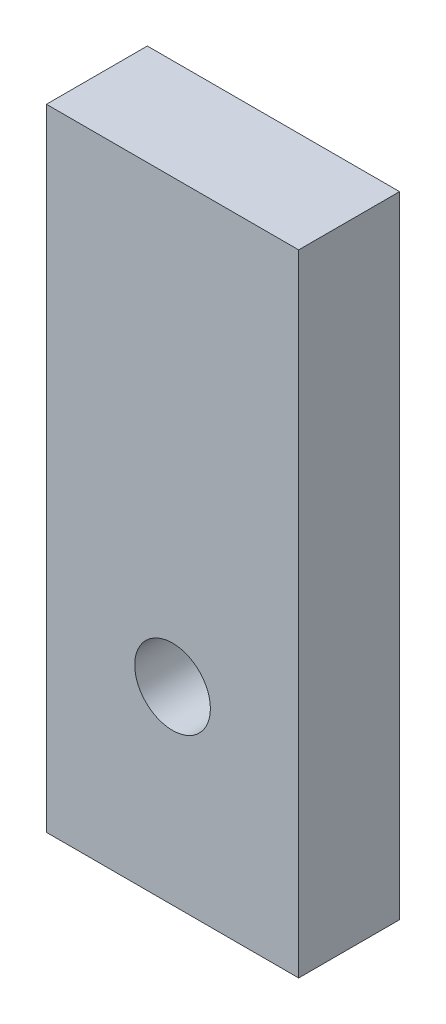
from build123d import *

# Parameters (mm, degrees)
SKETCH1_W           = 10
SKETCH1_H           = 25
SKETCH1_R           = 1.5
BOSS_EXTRUDE1_DEPTH = 4


with BuildPart() as part:
    # Sketch1 → Boss-Extrude1 (new body)
    with BuildSketch(Plane.XY):
        with Locations((5, 12.5)):
            Rectangle(SKETCH1_W, SKETCH1_H)
        with Locations((5, 7.5)):
            Circle(SKETCH1_R, mode=Mode.SUBTRACT)
    extrude(amount=BOSS_EXTRUDE1_DEPTH)


solid = part.part
